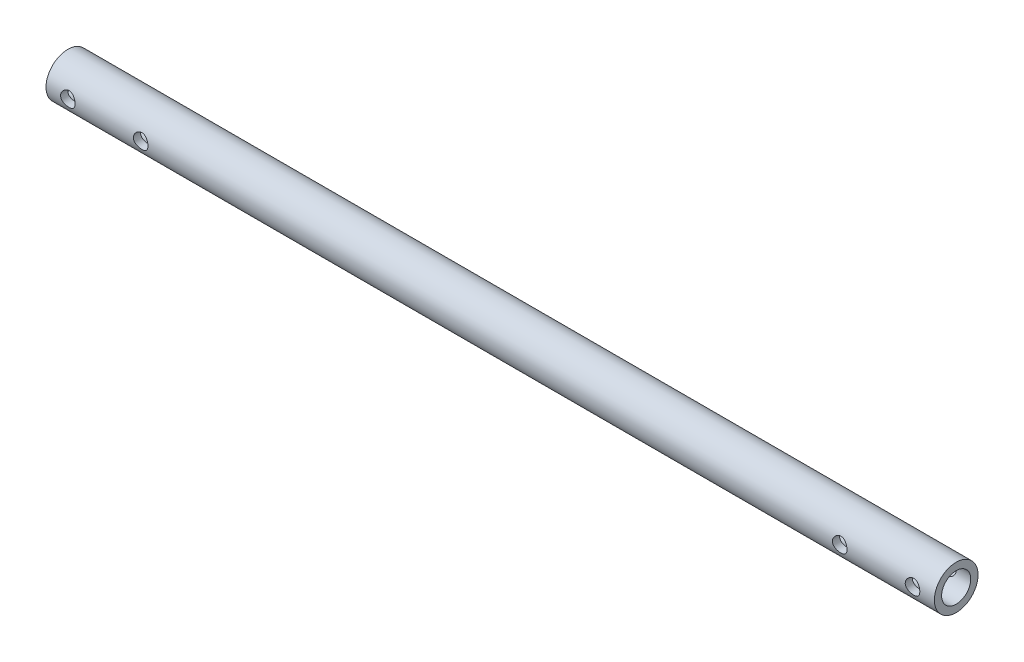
from build123d import *

# Parameters (mm, degrees)
SKETCH2_W          = 387.35
SKETCH2_H          = 3.175
SKETCH3_R          = 3.175
CUT_EXTRUDE1_DEPTH = 25.4


with BuildPart() as part:
    # Sketch2 → Revolve1 (revolve)
    with BuildSketch(Plane.XY, mode=Mode.PRIVATE) as revolve1_sk:
        with Locations((193.675, 7.9375)):
            Rectangle(SKETCH2_W, SKETCH2_H)
    revolve(revolve1_sk.sketch.rotate(Axis((0, 0, 0), (1, 0, 0)), 90), axis=Axis((0, 0, 0), (1, 0, 0)))

    # Sketch3 → Cut-Extrude1 (cut, symmetric)
    with BuildSketch(Plane.XY):
        with Locations((9.525, 0)):
            Circle(SKETCH3_R)
        with Locations((41.275, 0)):
            Circle(SKETCH3_R)
        with Locations((346.075, 0)):
            Circle(SKETCH3_R)
        with Locations((377.825, 0)):
            Circle(SKETCH3_R)
    extrude(amount=CUT_EXTRUDE1_DEPTH, both=True, mode=Mode.SUBTRACT)


solid = part.part
